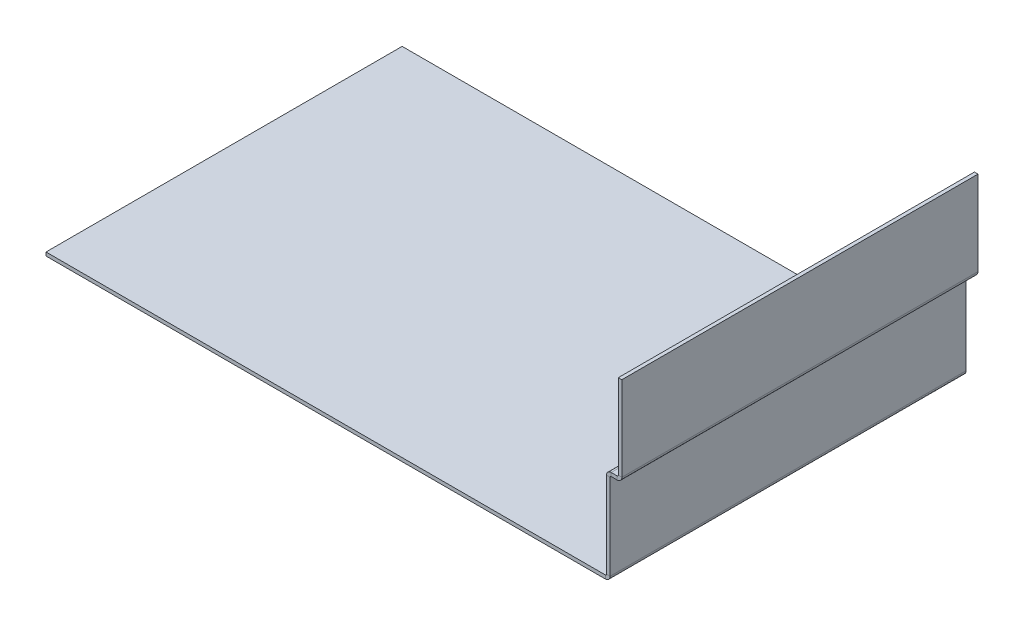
ISO-10303-21;
HEADER;
FILE_DESCRIPTION(('STEP AP214'),'2;1');
FILE_NAME('part.step','',(''),(''),'','','');
FILE_SCHEMA(('AUTOMOTIVE_DESIGN { 1 0 10303 214 1 1 1 1 }'));
ENDSEC;
DATA;
#1=APPLICATION_CONTEXT('core data for automotive mechanical design processes');
#2=APPLICATION_PROTOCOL_DEFINITION('international standard','automotive_design',2000,#1);
#3=PRODUCT_CONTEXT('',#1,'mechanical');
#4=PRODUCT('Part','Part','',(#3));
#5=PRODUCT_RELATED_PRODUCT_CATEGORY('part','',(#4));
#6=PRODUCT_DEFINITION_FORMATION('','',#4);
#7=PRODUCT_DEFINITION_CONTEXT('part definition',#1,'design');
#8=PRODUCT_DEFINITION('design','',#6,#7);
#9=PRODUCT_DEFINITION_SHAPE('','',#8);
#10=(LENGTH_UNIT() NAMED_UNIT(*) SI_UNIT(.MILLI.,.METRE.));
#11=(NAMED_UNIT(*) PLANE_ANGLE_UNIT() SI_UNIT($,.RADIAN.));
#12=(NAMED_UNIT(*) SI_UNIT($,.STERADIAN.) SOLID_ANGLE_UNIT());
#13=UNCERTAINTY_MEASURE_WITH_UNIT(LENGTH_MEASURE(1.E-05),#10,'distance_accuracy_value','');
#14=(GEOMETRIC_REPRESENTATION_CONTEXT(3) GLOBAL_UNCERTAINTY_ASSIGNED_CONTEXT((#13)) GLOBAL_UNIT_ASSIGNED_CONTEXT((#10,
#11,#12)) REPRESENTATION_CONTEXT('',''));
#15=CARTESIAN_POINT('',(0.,0.,0.));
#16=DIRECTION('',(0.,0.,1.));
#17=DIRECTION('',(1.,0.,0.));
#18=AXIS2_PLACEMENT_3D('',#15,#16,#17);
#19=CARTESIAN_POINT('',(139.863855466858,19.6942721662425,0.));
#20=DIRECTION('',(0.,1.,0.));
#21=DIRECTION('',(-1.,0.,0.));
#22=AXIS2_PLACEMENT_3D('',#19,#20,#21);
#23=PLANE('',#22);
#24=DIRECTION('',(1.,0.,0.));
#25=VECTOR('',#24,1.);
#26=CARTESIAN_POINT('',(139.863855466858,19.6942721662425,-76.5167255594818));
#27=LINE('',#26,#25);
#28=CARTESIAN_POINT('',(121.439583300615,19.6942721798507,-76.5167255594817));
#29=VERTEX_POINT('',#28);
#30=CARTESIAN_POINT('',(122.709583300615,19.6942721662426,-76.5167255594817));
#31=VERTEX_POINT('',#30);
#32=EDGE_CURVE('E282',#29,#31,#27,.T.);
#33=ORIENTED_EDGE('',*,*,#32,.T.);
#34=DIRECTION('',(0.,0.,1.));
#35=VECTOR('',#34,1.);
#36=CARTESIAN_POINT('',(122.709583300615,19.6942721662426,0.));
#37=LINE('',#36,#35);
#38=CARTESIAN_POINT('',(122.709583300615,19.6942720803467,0.));
#39=VERTEX_POINT('',#38);
#40=EDGE_CURVE('E42',#31,#39,#37,.T.);
#41=ORIENTED_EDGE('',*,*,#40,.T.);
#42=DIRECTION('',(-1.,0.,0.));
#43=VECTOR('',#42,1.);
#44=CARTESIAN_POINT('',(101.763855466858,19.6942721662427,0.));
#45=LINE('',#44,#43);
#46=CARTESIAN_POINT('',(121.439583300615,19.6942721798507,0.));
#47=VERTEX_POINT('',#46);
#48=EDGE_CURVE('E298',#39,#47,#45,.T.);
#49=ORIENTED_EDGE('',*,*,#48,.T.);
#50=DIRECTION('',(0.,0.,1.));
#51=VECTOR('',#50,1.);
#52=CARTESIAN_POINT('',(121.439583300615,19.6942721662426,0.));
#53=LINE('',#52,#51);
#54=EDGE_CURVE('E284',#29,#47,#53,.T.);
#55=ORIENTED_EDGE('',*,*,#54,.F.);
#56=EDGE_LOOP('',(#33,#41,#49,#55));
#57=FACE_BOUND('',#56,.T.);
#58=ADVANCED_FACE('F33',(#57),#23,.F.);
#59=CARTESIAN_POINT('',(139.863855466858,19.6942721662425,-76.5167255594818));
#60=DIRECTION('',(0.,0.,1.));
#61=DIRECTION('',(0.,-1.,0.));
#62=AXIS2_PLACEMENT_3D('',#59,#60,#61);
#63=PLANE('',#62);
#64=DIRECTION('',(1.,0.,0.));
#65=VECTOR('',#64,1.);
#66=CARTESIAN_POINT('',(139.863855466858,20.4562721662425,-76.5167255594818));
#67=LINE('',#66,#65);
#68=CARTESIAN_POINT('',(121.439583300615,20.4562721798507,-76.5167255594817));
#69=VERTEX_POINT('',#68);
#70=CARTESIAN_POINT('',(122.709583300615,20.4562721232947,-76.5167255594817));
#71=VERTEX_POINT('',#70);
#72=EDGE_CURVE('E295',#69,#71,#67,.T.);
#73=ORIENTED_EDGE('',*,*,#72,.T.);
#74=DIRECTION('',(0.,-1.,0.));
#75=VECTOR('',#74,1.);
#76=CARTESIAN_POINT('',(122.709583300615,19.6942721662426,-76.5167255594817));
#77=LINE('',#76,#75);
#78=EDGE_CURVE('E12',#71,#31,#77,.T.);
#79=ORIENTED_EDGE('',*,*,#78,.T.);
#80=ORIENTED_EDGE('',*,*,#32,.F.);
#81=DIRECTION('',(0.,-1.,0.));
#82=VECTOR('',#81,1.);
#83=CARTESIAN_POINT('',(121.439583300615,19.6942721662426,-76.5167255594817));
#84=LINE('',#83,#82);
#85=EDGE_CURVE('E281',#69,#29,#84,.T.);
#86=ORIENTED_EDGE('',*,*,#85,.F.);
#87=EDGE_LOOP('',(#73,#79,#80,#86));
#88=FACE_BOUND('',#87,.T.);
#89=ADVANCED_FACE('F35',(#88),#63,.F.);
#90=CARTESIAN_POINT('',(101.763855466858,19.6942721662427,0.));
#91=DIRECTION('',(0.,0.,-1.));
#92=DIRECTION('',(0.,1.,0.));
#93=AXIS2_PLACEMENT_3D('',#90,#91,#92);
#94=PLANE('',#93);
#95=ORIENTED_EDGE('',*,*,#48,.F.);
#96=DIRECTION('',(0.,1.,0.));
#97=VECTOR('',#96,1.);
#98=CARTESIAN_POINT('',(122.709583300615,19.6942721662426,0.));
#99=LINE('',#98,#97);
#100=CARTESIAN_POINT('',(122.709583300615,20.4562720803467,0.));
#101=VERTEX_POINT('',#100);
#102=EDGE_CURVE('E290',#39,#101,#99,.T.);
#103=ORIENTED_EDGE('',*,*,#102,.T.);
#104=DIRECTION('',(-1.,0.,0.));
#105=VECTOR('',#104,1.);
#106=CARTESIAN_POINT('',(101.763855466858,20.4562721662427,0.));
#107=LINE('',#106,#105);
#108=CARTESIAN_POINT('',(121.439583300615,20.4562721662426,0.));
#109=VERTEX_POINT('',#108);
#110=EDGE_CURVE('E37',#101,#109,#107,.T.);
#111=ORIENTED_EDGE('',*,*,#110,.T.);
#112=DIRECTION('',(0.,1.,0.));
#113=VECTOR('',#112,1.);
#114=CARTESIAN_POINT('',(121.439583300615,19.6942721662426,0.));
#115=LINE('',#114,#113);
#116=EDGE_CURVE('E286',#47,#109,#115,.T.);
#117=ORIENTED_EDGE('',*,*,#116,.F.);
#118=EDGE_LOOP('',(#95,#103,#111,#117));
#119=FACE_BOUND('',#118,.T.);
#120=ADVANCED_FACE('F320',(#119),#94,.F.);
#121=CARTESIAN_POINT('',(139.863855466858,20.4562721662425,0.));
#122=DIRECTION('',(0.,1.,0.));
#123=DIRECTION('',(-1.,0.,0.));
#124=AXIS2_PLACEMENT_3D('',#121,#122,#123);
#125=PLANE('',#124);
#126=DIRECTION('',(0.,0.,1.));
#127=VECTOR('',#126,1.);
#128=CARTESIAN_POINT('',(122.709583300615,20.4562721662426,0.));
#129=LINE('',#128,#127);
#130=EDGE_CURVE('E288',#71,#101,#129,.T.);
#131=ORIENTED_EDGE('',*,*,#130,.F.);
#132=ORIENTED_EDGE('',*,*,#72,.F.);
#133=DIRECTION('',(0.,0.,1.));
#134=VECTOR('',#133,1.);
#135=CARTESIAN_POINT('',(121.439583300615,20.4562721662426,0.));
#136=LINE('',#135,#134);
#137=EDGE_CURVE('E278',#69,#109,#136,.T.);
#138=ORIENTED_EDGE('',*,*,#137,.T.);
#139=ORIENTED_EDGE('',*,*,#110,.F.);
#140=EDGE_LOOP('',(#131,#132,#138,#139));
#141=FACE_BOUND('',#140,.T.);
#142=ADVANCED_FACE('F315',(#141),#125,.T.);
#143=CARTESIAN_POINT('',(0.,0.762,-76.5167255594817));
#144=DIRECTION('',(1.,0.,0.));
#145=DIRECTION('',(0.,0.,-1.));
#146=AXIS2_PLACEMENT_3D('',#143,#144,#145);
#147=PLANE('',#146);
#148=DIRECTION('',(0.,0.,1.));
#149=VECTOR('',#148,1.);
#150=CARTESIAN_POINT('',(0.,0.,-76.5167255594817));
#151=LINE('',#150,#149);
#152=CARTESIAN_POINT('',(0.,0.,-76.5167255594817));
#153=VERTEX_POINT('',#152);
#154=CARTESIAN_POINT('',(0.,0.,0.));
#155=VERTEX_POINT('',#154);
#156=EDGE_CURVE('E274',#153,#155,#151,.T.);
#157=ORIENTED_EDGE('',*,*,#156,.T.);
#158=DIRECTION('',(0.,-1.,0.));
#159=VECTOR('',#158,1.);
#160=CARTESIAN_POINT('',(0.,0.762,0.));
#161=LINE('',#160,#159);
#162=CARTESIAN_POINT('',(0.,0.762,0.));
#163=VERTEX_POINT('',#162);
#164=EDGE_CURVE('E268',#163,#155,#161,.T.);
#165=ORIENTED_EDGE('',*,*,#164,.F.);
#166=DIRECTION('',(0.,0.,1.));
#167=VECTOR('',#166,1.);
#168=CARTESIAN_POINT('',(0.,0.762,-76.5167255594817));
#169=LINE('',#168,#167);
#170=CARTESIAN_POINT('',(0.,0.762,-76.5167255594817));
#171=VERTEX_POINT('',#170);
#172=EDGE_CURVE('E251',#171,#163,#169,.T.);
#173=ORIENTED_EDGE('',*,*,#172,.F.);
#174=DIRECTION('',(0.,-1.,0.));
#175=VECTOR('',#174,1.);
#176=CARTESIAN_POINT('',(0.,0.762,-76.5167255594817));
#177=LINE('',#176,#175);
#178=EDGE_CURVE('E271',#171,#153,#177,.T.);
#179=ORIENTED_EDGE('',*,*,#178,.T.);
#180=EDGE_LOOP('',(#157,#165,#173,#179));
#181=FACE_BOUND('',#180,.T.);
#182=ADVANCED_FACE('F356',(#181),#147,.F.);
#183=CARTESIAN_POINT('',(0.,0.762,0.));
#184=DIRECTION('',(0.,0.,-1.));
#185=DIRECTION('',(-1.,0.,0.));
#186=AXIS2_PLACEMENT_3D('',#183,#184,#185);
#187=PLANE('',#186);
#188=DIRECTION('',(0.,-1.,0.));
#189=VECTOR('',#188,1.);
#190=CARTESIAN_POINT('',(120.169583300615,0.762,0.));
#191=LINE('',#190,#189);
#192=CARTESIAN_POINT('',(120.169583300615,0.762,0.));
#193=VERTEX_POINT('',#192);
#194=CARTESIAN_POINT('',(120.169583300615,0.,0.));
#195=VERTEX_POINT('',#194);
#196=EDGE_CURVE('E248',#193,#195,#191,.T.);
#197=ORIENTED_EDGE('',*,*,#196,.F.);
#198=DIRECTION('',(1.,0.,0.));
#199=VECTOR('',#198,1.);
#200=CARTESIAN_POINT('',(0.,0.762,0.));
#201=LINE('',#200,#199);
#202=EDGE_CURVE('E256',#163,#193,#201,.T.);
#203=ORIENTED_EDGE('',*,*,#202,.F.);
#204=ORIENTED_EDGE('',*,*,#164,.T.);
#205=DIRECTION('',(1.,0.,0.));
#206=VECTOR('',#205,1.);
#207=CARTESIAN_POINT('',(0.,0.,0.));
#208=LINE('',#207,#206);
#209=EDGE_CURVE('E265',#155,#195,#208,.T.);
#210=ORIENTED_EDGE('',*,*,#209,.T.);
#211=EDGE_LOOP('',(#197,#203,#204,#210));
#212=FACE_BOUND('',#211,.T.);
#213=ADVANCED_FACE('F401',(#212),#187,.F.);
#214=CARTESIAN_POINT('',(0.,0.,0.));
#215=DIRECTION('',(0.,1.,0.));
#216=DIRECTION('',(0.,0.,1.));
#217=AXIS2_PLACEMENT_3D('',#214,#215,#216);
#218=PLANE('',#217);
#219=DIRECTION('',(0.,0.,-1.));
#220=VECTOR('',#219,1.);
#221=CARTESIAN_POINT('',(120.169583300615,0.,-76.5167255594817));
#222=LINE('',#221,#220);
#223=CARTESIAN_POINT('',(120.169583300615,0.,-76.5167255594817));
#224=VERTEX_POINT('',#223);
#225=EDGE_CURVE('E263',#224,#195,#222,.F.);
#226=ORIENTED_EDGE('',*,*,#225,.T.);
#227=ORIENTED_EDGE('',*,*,#209,.F.);
#228=ORIENTED_EDGE('',*,*,#156,.F.);
#229=DIRECTION('',(-1.,0.,0.));
#230=VECTOR('',#229,1.);
#231=CARTESIAN_POINT('',(0.,0.,-76.5167255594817));
#232=LINE('',#231,#230);
#233=EDGE_CURVE('E259',#224,#153,#232,.T.);
#234=ORIENTED_EDGE('',*,*,#233,.F.);
#235=EDGE_LOOP('',(#226,#227,#228,#234));
#236=FACE_BOUND('',#235,.T.);
#237=ADVANCED_FACE('F397',(#236),#218,.F.);
#238=CARTESIAN_POINT('',(0.,0.762,-76.5167255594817));
#239=DIRECTION('',(0.,0.,1.));
#240=DIRECTION('',(1.,0.,0.));
#241=AXIS2_PLACEMENT_3D('',#238,#239,#240);
#242=PLANE('',#241);
#243=DIRECTION('',(0.,-1.,0.));
#244=VECTOR('',#243,1.);
#245=CARTESIAN_POINT('',(120.169583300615,0.762,-76.5167255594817));
#246=LINE('',#245,#244);
#247=CARTESIAN_POINT('',(120.169583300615,0.762,-76.5167255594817));
#248=VERTEX_POINT('',#247);
#249=EDGE_CURVE('E261',#248,#224,#246,.T.);
#250=ORIENTED_EDGE('',*,*,#249,.T.);
#251=ORIENTED_EDGE('',*,*,#233,.T.);
#252=ORIENTED_EDGE('',*,*,#178,.F.);
#253=DIRECTION('',(-1.,0.,0.));
#254=VECTOR('',#253,1.);
#255=CARTESIAN_POINT('',(0.,0.762,-76.5167255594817));
#256=LINE('',#255,#254);
#257=EDGE_CURVE('E254',#248,#171,#256,.T.);
#258=ORIENTED_EDGE('',*,*,#257,.F.);
#259=EDGE_LOOP('',(#250,#251,#252,#258));
#260=FACE_BOUND('',#259,.T.);
#261=ADVANCED_FACE('F393',(#260),#242,.F.);
#262=CARTESIAN_POINT('',(0.,0.762,0.));
#263=DIRECTION('',(0.,1.,0.));
#264=DIRECTION('',(0.,0.,1.));
#265=AXIS2_PLACEMENT_3D('',#262,#263,#264);
#266=PLANE('',#265);
#267=ORIENTED_EDGE('',*,*,#202,.T.);
#268=DIRECTION('',(0.,0.,-1.));
#269=VECTOR('',#268,1.);
#270=CARTESIAN_POINT('',(120.169583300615,0.762,-76.5167255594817));
#271=LINE('',#270,#269);
#272=EDGE_CURVE('E233',#248,#193,#271,.F.);
#273=ORIENTED_EDGE('',*,*,#272,.F.);
#274=ORIENTED_EDGE('',*,*,#257,.T.);
#275=ORIENTED_EDGE('',*,*,#172,.T.);
#276=EDGE_LOOP('',(#267,#273,#274,#275));
#277=FACE_BOUND('',#276,.T.);
#278=ADVANCED_FACE('F389',(#277),#266,.T.);
#279=CARTESIAN_POINT('',(120.169583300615,1.016,0.));
#280=DIRECTION('',(0.,0.,1.));
#281=DIRECTION('',(1.,0.,0.));
#282=AXIS2_PLACEMENT_3D('',#279,#280,#281);
#283=PLANE('',#282);
#284=DIRECTION('',(1.,0.,0.));
#285=VECTOR('',#284,1.);
#286=CARTESIAN_POINT('',(120.423583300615,1.016,0.));
#287=LINE('',#286,#285);
#288=CARTESIAN_POINT('',(120.423583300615,1.016,0.));
#289=VERTEX_POINT('',#288);
#290=CARTESIAN_POINT('',(121.185583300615,1.016,0.));
#291=VERTEX_POINT('',#290);
#292=EDGE_CURVE('E203',#289,#291,#287,.T.);
#293=ORIENTED_EDGE('',*,*,#292,.F.);
#294=CARTESIAN_POINT('',(120.169583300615,1.016,0.));
#295=DIRECTION('',(0.,0.,-1.));
#296=DIRECTION('',(-1.,0.,0.));
#297=AXIS2_PLACEMENT_3D('',#294,#295,#296);
#298=CIRCLE('',#297,0.254000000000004);
#299=EDGE_CURVE('E230',#193,#289,#298,.F.);
#300=ORIENTED_EDGE('',*,*,#299,.F.);
#301=ORIENTED_EDGE('',*,*,#196,.T.);
#302=CARTESIAN_POINT('',(120.169583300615,1.016,0.));
#303=DIRECTION('',(0.,0.,-1.));
#304=DIRECTION('',(-1.,0.,0.));
#305=AXIS2_PLACEMENT_3D('',#302,#303,#304);
#306=CIRCLE('',#305,1.016);
#307=EDGE_CURVE('E245',#195,#291,#306,.F.);
#308=ORIENTED_EDGE('',*,*,#307,.T.);
#309=EDGE_LOOP('',(#293,#300,#301,#308));
#310=FACE_BOUND('',#309,.T.);
#311=ADVANCED_FACE('F385',(#310),#283,.T.);
#312=CARTESIAN_POINT('',(120.169583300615,1.016,-76.5167255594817));
#313=DIRECTION('',(0.,0.,-1.));
#314=DIRECTION('',(1.,0.,0.));
#315=AXIS2_PLACEMENT_3D('',#312,#313,#314);
#316=CYLINDRICAL_SURFACE('',#315,1.016);
#317=ORIENTED_EDGE('',*,*,#225,.F.);
#318=CARTESIAN_POINT('',(120.169583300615,1.016,-76.5167255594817));
#319=DIRECTION('',(0.,0.,-1.));
#320=DIRECTION('',(-1.,0.,0.));
#321=AXIS2_PLACEMENT_3D('',#318,#319,#320);
#322=CIRCLE('',#321,1.016);
#323=CARTESIAN_POINT('',(121.185583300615,1.016,-76.5167255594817));
#324=VERTEX_POINT('',#323);
#325=EDGE_CURVE('E236',#324,#224,#322,.T.);
#326=ORIENTED_EDGE('',*,*,#325,.F.);
#327=DIRECTION('',(0.,0.,1.));
#328=VECTOR('',#327,1.);
#329=CARTESIAN_POINT('',(121.185583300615,1.016,0.));
#330=LINE('',#329,#328);
#331=EDGE_CURVE('E242',#324,#291,#330,.T.);
#332=ORIENTED_EDGE('',*,*,#331,.T.);
#333=ORIENTED_EDGE('',*,*,#307,.F.);
#334=EDGE_LOOP('',(#317,#326,#332,#333));
#335=FACE_BOUND('',#334,.T.);
#336=ADVANCED_FACE('F381',(#335),#316,.T.);
#337=CARTESIAN_POINT('',(120.169583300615,1.016,-76.5167255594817));
#338=DIRECTION('',(0.,0.,1.));
#339=DIRECTION('',(1.,0.,0.));
#340=AXIS2_PLACEMENT_3D('',#337,#338,#339);
#341=PLANE('',#340);
#342=CARTESIAN_POINT('',(120.169583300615,1.016,-76.5167255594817));
#343=DIRECTION('',(0.,0.,-1.));
#344=DIRECTION('',(-1.,0.,0.));
#345=AXIS2_PLACEMENT_3D('',#342,#343,#344);
#346=CIRCLE('',#345,0.254000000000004);
#347=CARTESIAN_POINT('',(120.423583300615,1.016,-76.5167255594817));
#348=VERTEX_POINT('',#347);
#349=EDGE_CURVE('E225',#348,#248,#346,.T.);
#350=ORIENTED_EDGE('',*,*,#349,.F.);
#351=DIRECTION('',(1.,0.,0.));
#352=VECTOR('',#351,1.);
#353=CARTESIAN_POINT('',(120.423583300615,1.016,-76.5167255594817));
#354=LINE('',#353,#352);
#355=EDGE_CURVE('E239',#348,#324,#354,.T.);
#356=ORIENTED_EDGE('',*,*,#355,.T.);
#357=ORIENTED_EDGE('',*,*,#325,.T.);
#358=ORIENTED_EDGE('',*,*,#249,.F.);
#359=EDGE_LOOP('',(#350,#356,#357,#358));
#360=FACE_BOUND('',#359,.T.);
#361=ADVANCED_FACE('F377',(#360),#341,.F.);
#362=CARTESIAN_POINT('',(120.169583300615,1.016,-76.5167255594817));
#363=DIRECTION('',(0.,0.,-1.));
#364=DIRECTION('',(1.,0.,0.));
#365=AXIS2_PLACEMENT_3D('',#362,#363,#364);
#366=CYLINDRICAL_SURFACE('',#365,0.254000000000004);
#367=ORIENTED_EDGE('',*,*,#272,.T.);
#368=ORIENTED_EDGE('',*,*,#299,.T.);
#369=DIRECTION('',(0.,0.,-1.));
#370=VECTOR('',#369,1.);
#371=CARTESIAN_POINT('',(120.423583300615,1.016,0.));
#372=LINE('',#371,#370);
#373=EDGE_CURVE('E228',#289,#348,#372,.T.);
#374=ORIENTED_EDGE('',*,*,#373,.T.);
#375=ORIENTED_EDGE('',*,*,#349,.T.);
#376=EDGE_LOOP('',(#367,#368,#374,#375));
#377=FACE_BOUND('',#376,.T.);
#378=ADVANCED_FACE('F373',(#377),#366,.F.);
#379=CARTESIAN_POINT('',(120.423583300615,38.862,0.));
#380=DIRECTION('',(-1.,0.,0.));
#381=DIRECTION('',(0.,-1.,0.));
#382=AXIS2_PLACEMENT_3D('',#379,#380,#381);
#383=PLANE('',#382);
#384=DIRECTION('',(0.,0.,1.));
#385=VECTOR('',#384,1.);
#386=CARTESIAN_POINT('',(120.423583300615,19.4402721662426,0.));
#387=LINE('',#386,#385);
#388=CARTESIAN_POINT('',(120.423583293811,19.4402721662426,-76.5167255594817));
#389=VERTEX_POINT('',#388);
#390=CARTESIAN_POINT('',(120.423583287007,19.4402721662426,0.));
#391=VERTEX_POINT('',#390);
#392=EDGE_CURVE('E202',#389,#391,#387,.T.);
#393=ORIENTED_EDGE('',*,*,#392,.F.);
#394=DIRECTION('',(0.,1.,0.));
#395=VECTOR('',#394,1.);
#396=CARTESIAN_POINT('',(120.423583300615,38.862,-76.5167255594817));
#397=LINE('',#396,#395);
#398=EDGE_CURVE('E222',#348,#389,#397,.T.);
#399=ORIENTED_EDGE('',*,*,#398,.F.);
#400=ORIENTED_EDGE('',*,*,#373,.F.);
#401=DIRECTION('',(0.,-1.,0.));
#402=VECTOR('',#401,1.);
#403=CARTESIAN_POINT('',(120.423583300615,0.762,0.));
#404=LINE('',#403,#402);
#405=EDGE_CURVE('E206',#391,#289,#404,.T.);
#406=ORIENTED_EDGE('',*,*,#405,.F.);
#407=EDGE_LOOP('',(#393,#399,#400,#406));
#408=FACE_BOUND('',#407,.T.);
#409=ADVANCED_FACE('F369',(#408),#383,.T.);
#410=CARTESIAN_POINT('',(121.185583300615,38.862,-76.5167255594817));
#411=DIRECTION('',(0.,0.,1.));
#412=DIRECTION('',(1.,0.,0.));
#413=AXIS2_PLACEMENT_3D('',#410,#411,#412);
#414=PLANE('',#413);
#415=ORIENTED_EDGE('',*,*,#398,.T.);
#416=DIRECTION('',(1.,0.,0.));
#417=VECTOR('',#416,1.);
#418=CARTESIAN_POINT('',(121.185583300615,19.4402721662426,-76.5167255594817));
#419=LINE('',#418,#417);
#420=CARTESIAN_POINT('',(121.185583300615,19.4402721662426,-76.5167255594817));
#421=VERTEX_POINT('',#420);
#422=EDGE_CURVE('E219',#389,#421,#419,.T.);
#423=ORIENTED_EDGE('',*,*,#422,.T.);
#424=DIRECTION('',(0.,1.,0.));
#425=VECTOR('',#424,1.);
#426=CARTESIAN_POINT('',(121.185583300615,38.862,-76.5167255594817));
#427=LINE('',#426,#425);
#428=EDGE_CURVE('E216',#324,#421,#427,.T.);
#429=ORIENTED_EDGE('',*,*,#428,.F.);
#430=ORIENTED_EDGE('',*,*,#355,.F.);
#431=EDGE_LOOP('',(#415,#423,#429,#430));
#432=FACE_BOUND('',#431,.T.);
#433=ADVANCED_FACE('F365',(#432),#414,.F.);
#434=CARTESIAN_POINT('',(121.185583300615,38.862,0.));
#435=DIRECTION('',(-1.,0.,0.));
#436=DIRECTION('',(0.,-1.,0.));
#437=AXIS2_PLACEMENT_3D('',#434,#435,#436);
#438=PLANE('',#437);
#439=ORIENTED_EDGE('',*,*,#428,.T.);
#440=DIRECTION('',(0.,0.,1.));
#441=VECTOR('',#440,1.);
#442=CARTESIAN_POINT('',(121.185583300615,19.4402721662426,0.));
#443=LINE('',#442,#441);
#444=CARTESIAN_POINT('',(121.185583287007,19.4402721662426,0.));
#445=VERTEX_POINT('',#444);
#446=EDGE_CURVE('E213',#421,#445,#443,.T.);
#447=ORIENTED_EDGE('',*,*,#446,.T.);
#448=DIRECTION('',(0.,-1.,0.));
#449=VECTOR('',#448,1.);
#450=CARTESIAN_POINT('',(121.185583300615,0.761999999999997,0.));
#451=LINE('',#450,#449);
#452=EDGE_CURVE('E211',#445,#291,#451,.T.);
#453=ORIENTED_EDGE('',*,*,#452,.T.);
#454=ORIENTED_EDGE('',*,*,#331,.F.);
#455=EDGE_LOOP('',(#439,#447,#453,#454));
#456=FACE_BOUND('',#455,.T.);
#457=ADVANCED_FACE('F361',(#456),#438,.F.);
#458=CARTESIAN_POINT('',(121.185583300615,0.761999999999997,0.));
#459=DIRECTION('',(0.,0.,-1.));
#460=DIRECTION('',(-1.,0.,0.));
#461=AXIS2_PLACEMENT_3D('',#458,#459,#460);
#462=PLANE('',#461);
#463=ORIENTED_EDGE('',*,*,#452,.F.);
#464=DIRECTION('',(-1.,0.,0.));
#465=VECTOR('',#464,1.);
#466=CARTESIAN_POINT('',(121.185583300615,19.4402721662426,0.));
#467=LINE('',#466,#465);
#468=EDGE_CURVE('E208',#445,#391,#467,.T.);
#469=ORIENTED_EDGE('',*,*,#468,.T.);
#470=ORIENTED_EDGE('',*,*,#405,.T.);
#471=ORIENTED_EDGE('',*,*,#292,.T.);
#472=EDGE_LOOP('',(#463,#469,#470,#471));
#473=FACE_BOUND('',#472,.T.);
#474=ADVANCED_FACE('F357',(#473),#462,.F.);
#475=CARTESIAN_POINT('',(121.439583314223,19.4402721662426,-76.5167255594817));
#476=DIRECTION('',(0.,0.,-1.));
#477=DIRECTION('',(-1.,0.,0.));
#478=AXIS2_PLACEMENT_3D('',#475,#476,#477);
#479=PLANE('',#478);
#480=ORIENTED_EDGE('',*,*,#85,.T.);
#481=CARTESIAN_POINT('',(121.439583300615,19.4402721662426,-76.5167255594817));
#482=DIRECTION('',(0.,0.,-1.));
#483=DIRECTION('',(0.,1.,0.));
#484=AXIS2_PLACEMENT_3D('',#481,#482,#483);
#485=CIRCLE('',#484,0.254000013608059);
#486=EDGE_CURVE('E193',#29,#421,#485,.F.);
#487=ORIENTED_EDGE('',*,*,#486,.T.);
#488=ORIENTED_EDGE('',*,*,#422,.F.);
#489=CARTESIAN_POINT('',(121.439583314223,19.4402721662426,-76.5167255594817));
#490=DIRECTION('',(0.,0.,1.));
#491=DIRECTION('',(-1.,0.,0.));
#492=AXIS2_PLACEMENT_3D('',#489,#490,#491);
#493=CIRCLE('',#492,1.01600002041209);
#494=EDGE_CURVE('E198',#69,#389,#493,.T.);
#495=ORIENTED_EDGE('',*,*,#494,.F.);
#496=EDGE_LOOP('',(#480,#487,#488,#495));
#497=FACE_BOUND('',#496,.T.);
#498=ADVANCED_FACE('F360',(#497),#479,.T.);
#499=CARTESIAN_POINT('',(121.439583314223,19.4402721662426,0.));
#500=DIRECTION('',(0.,0.,1.));
#501=DIRECTION('',(0.,-1.,0.));
#502=AXIS2_PLACEMENT_3D('',#499,#500,#501);
#503=PLANE('',#502);
#504=CARTESIAN_POINT('',(121.439583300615,19.4402721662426,0.));
#505=DIRECTION('',(0.,0.,-1.));
#506=DIRECTION('',(0.,1.,0.));
#507=AXIS2_PLACEMENT_3D('',#504,#505,#506);
#508=CIRCLE('',#507,0.254000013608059);
#509=EDGE_CURVE('E195',#445,#47,#508,.T.);
#510=ORIENTED_EDGE('',*,*,#509,.T.);
#511=ORIENTED_EDGE('',*,*,#116,.T.);
#512=CARTESIAN_POINT('',(121.439583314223,19.4402721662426,0.));
#513=DIRECTION('',(0.,0.,-1.));
#514=DIRECTION('',(0.,-1.,0.));
#515=AXIS2_PLACEMENT_3D('',#512,#513,#514);
#516=CIRCLE('',#515,1.01600002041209);
#517=EDGE_CURVE('E58',#391,#109,#516,.T.);
#518=ORIENTED_EDGE('',*,*,#517,.F.);
#519=ORIENTED_EDGE('',*,*,#468,.F.);
#520=EDGE_LOOP('',(#510,#511,#518,#519));
#521=FACE_BOUND('',#520,.T.);
#522=ADVANCED_FACE('F409',(#521),#503,.T.);
#523=CARTESIAN_POINT('',(121.439583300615,19.4402721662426,38.2686576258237));
#524=DIRECTION('',(0.,0.,-1.));
#525=DIRECTION('',(0.,1.,0.));
#526=AXIS2_PLACEMENT_3D('',#523,#524,#525);
#527=CYLINDRICAL_SURFACE('',#526,1.01600001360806);
#528=ORIENTED_EDGE('',*,*,#392,.T.);
#529=ORIENTED_EDGE('',*,*,#517,.T.);
#530=ORIENTED_EDGE('',*,*,#137,.F.);
#531=ORIENTED_EDGE('',*,*,#494,.T.);
#532=EDGE_LOOP('',(#528,#529,#530,#531));
#533=FACE_BOUND('',#532,.T.);
#534=ADVANCED_FACE('F412',(#533),#527,.T.);
#535=CARTESIAN_POINT('',(121.439583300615,19.4402721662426,38.2686576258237));
#536=DIRECTION('',(0.,0.,-1.));
#537=DIRECTION('',(0.,1.,0.));
#538=AXIS2_PLACEMENT_3D('',#535,#536,#537);
#539=CYLINDRICAL_SURFACE('',#538,0.254000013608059);
#540=ORIENTED_EDGE('',*,*,#446,.F.);
#541=ORIENTED_EDGE('',*,*,#486,.F.);
#542=ORIENTED_EDGE('',*,*,#54,.T.);
#543=ORIENTED_EDGE('',*,*,#509,.F.);
#544=EDGE_LOOP('',(#540,#541,#542,#543));
#545=FACE_BOUND('',#544,.T.);
#546=ADVANCED_FACE('F414',(#545),#539,.F.);
#547=CARTESIAN_POINT('',(122.709583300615,20.7102722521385,-76.5167255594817));
#548=DIRECTION('',(0.,0.,1.));
#549=DIRECTION('',(1.,0.,0.));
#550=AXIS2_PLACEMENT_3D('',#547,#548,#549);
#551=PLANE('',#550);
#552=DIRECTION('',(1.,0.,0.));
#553=VECTOR('',#552,1.);
#554=CARTESIAN_POINT('',(123.725583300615,20.7102721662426,-76.5167255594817));
#555=LINE('',#554,#553);
#556=CARTESIAN_POINT('',(122.963583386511,20.7102721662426,-76.5167255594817));
#557=VERTEX_POINT('',#556);
#558=CARTESIAN_POINT('',(123.725583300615,20.7102721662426,-76.5167255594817));
#559=VERTEX_POINT('',#558);
#560=EDGE_CURVE('E154',#557,#559,#555,.T.);
#561=ORIENTED_EDGE('',*,*,#560,.T.);
#562=CARTESIAN_POINT('',(122.709583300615,20.7102721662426,-76.5167255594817));
#563=DIRECTION('',(0.,0.,-1.));
#564=DIRECTION('',(0.,1.,0.));
#565=AXIS2_PLACEMENT_3D('',#562,#563,#564);
#566=CIRCLE('',#565,1.01600008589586);
#567=EDGE_CURVE('E50',#559,#31,#566,.T.);
#568=ORIENTED_EDGE('',*,*,#567,.T.);
#569=ORIENTED_EDGE('',*,*,#78,.F.);
#570=CARTESIAN_POINT('',(122.709583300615,20.7102722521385,-76.5167255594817));
#571=DIRECTION('',(0.,0.,-1.));
#572=DIRECTION('',(1.,0.,0.));
#573=AXIS2_PLACEMENT_3D('',#570,#571,#572);
#574=CIRCLE('',#573,0.254000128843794);
#575=EDGE_CURVE('E187',#557,#71,#574,.T.);
#576=ORIENTED_EDGE('',*,*,#575,.F.);
#577=EDGE_LOOP('',(#561,#568,#569,#576));
#578=FACE_BOUND('',#577,.T.);
#579=ADVANCED_FACE('F308',(#578),#551,.F.);
#580=CARTESIAN_POINT('',(122.709583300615,20.7102722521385,0.));
#581=DIRECTION('',(0.,0.,-1.));
#582=DIRECTION('',(0.,1.,0.));
#583=AXIS2_PLACEMENT_3D('',#580,#581,#582);
#584=PLANE('',#583);
#585=CARTESIAN_POINT('',(122.709583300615,20.7102721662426,0.));
#586=DIRECTION('',(0.,0.,-1.));
#587=DIRECTION('',(0.,1.,0.));
#588=AXIS2_PLACEMENT_3D('',#585,#586,#587);
#589=CIRCLE('',#588,1.01600008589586);
#590=CARTESIAN_POINT('',(123.725583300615,20.7102721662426,0.));
#591=VERTEX_POINT('',#590);
#592=EDGE_CURVE('E184',#39,#591,#589,.F.);
#593=ORIENTED_EDGE('',*,*,#592,.T.);
#594=DIRECTION('',(-1.,0.,0.));
#595=VECTOR('',#594,1.);
#596=CARTESIAN_POINT('',(123.725583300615,20.7102721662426,0.));
#597=LINE('',#596,#595);
#598=CARTESIAN_POINT('',(122.963583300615,20.7102721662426,0.));
#599=VERTEX_POINT('',#598);
#600=EDGE_CURVE('E173',#591,#599,#597,.T.);
#601=ORIENTED_EDGE('',*,*,#600,.T.);
#602=CARTESIAN_POINT('',(122.709583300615,20.7102722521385,0.));
#603=DIRECTION('',(0.,0.,1.));
#604=DIRECTION('',(0.,1.,0.));
#605=AXIS2_PLACEMENT_3D('',#602,#603,#604);
#606=CIRCLE('',#605,0.254000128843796);
#607=EDGE_CURVE('E190',#101,#599,#606,.T.);
#608=ORIENTED_EDGE('',*,*,#607,.F.);
#609=ORIENTED_EDGE('',*,*,#102,.F.);
#610=EDGE_LOOP('',(#593,#601,#608,#609));
#611=FACE_BOUND('',#610,.T.);
#612=ADVANCED_FACE('F323',(#611),#584,.F.);
#613=CARTESIAN_POINT('',(122.709583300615,20.7102721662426,38.2686576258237));
#614=DIRECTION('',(0.,0.,-1.));
#615=DIRECTION('',(0.,1.,0.));
#616=AXIS2_PLACEMENT_3D('',#613,#614,#615);
#617=CYLINDRICAL_SURFACE('',#616,0.254000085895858);
#618=ORIENTED_EDGE('',*,*,#130,.T.);
#619=ORIENTED_EDGE('',*,*,#607,.T.);
#620=DIRECTION('',(0.,0.,1.));
#621=VECTOR('',#620,1.);
#622=CARTESIAN_POINT('',(122.963583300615,20.7102721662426,0.));
#623=LINE('',#622,#621);
#624=EDGE_CURVE('E168',#557,#599,#623,.T.);
#625=ORIENTED_EDGE('',*,*,#624,.F.);
#626=ORIENTED_EDGE('',*,*,#575,.T.);
#627=EDGE_LOOP('',(#618,#619,#625,#626));
#628=FACE_BOUND('',#627,.T.);
#629=ADVANCED_FACE('F311',(#628),#617,.F.);
#630=CARTESIAN_POINT('',(122.709583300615,20.7102721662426,38.2686576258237));
#631=DIRECTION('',(0.,0.,-1.));
#632=DIRECTION('',(0.,1.,0.));
#633=AXIS2_PLACEMENT_3D('',#630,#631,#632);
#634=CYLINDRICAL_SURFACE('',#633,1.01600008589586);
#635=ORIENTED_EDGE('',*,*,#40,.F.);
#636=ORIENTED_EDGE('',*,*,#567,.F.);
#637=DIRECTION('',(0.,0.,1.));
#638=VECTOR('',#637,1.);
#639=CARTESIAN_POINT('',(123.725583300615,20.7102721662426,0.));
#640=LINE('',#639,#638);
#641=EDGE_CURVE('E176',#559,#591,#640,.T.);
#642=ORIENTED_EDGE('',*,*,#641,.T.);
#643=ORIENTED_EDGE('',*,*,#592,.F.);
#644=EDGE_LOOP('',(#635,#636,#642,#643));
#645=FACE_BOUND('',#644,.T.);
#646=ADVANCED_FACE('F325',(#645),#634,.T.);
#647=CARTESIAN_POINT('',(123.725583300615,38.862,0.));
#648=DIRECTION('',(0.,-1.,0.));
#649=DIRECTION('',(1.,0.,0.));
#650=AXIS2_PLACEMENT_3D('',#647,#648,#649);
#651=PLANE('',#650);
#652=DIRECTION('',(0.,0.,1.));
#653=VECTOR('',#652,1.);
#654=CARTESIAN_POINT('',(122.963583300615,38.862,0.));
#655=LINE('',#654,#653);
#656=CARTESIAN_POINT('',(122.963583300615,38.862,-76.5167255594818));
#657=VERTEX_POINT('',#656);
#658=CARTESIAN_POINT('',(122.963583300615,38.862,0.));
#659=VERTEX_POINT('',#658);
#660=EDGE_CURVE('E164',#657,#659,#655,.T.);
#661=ORIENTED_EDGE('',*,*,#660,.T.);
#662=DIRECTION('',(-1.,0.,0.));
#663=VECTOR('',#662,1.);
#664=CARTESIAN_POINT('',(123.725583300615,38.862,0.));
#665=LINE('',#664,#663);
#666=CARTESIAN_POINT('',(123.725583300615,38.862,0.));
#667=VERTEX_POINT('',#666);
#668=EDGE_CURVE('E334',#667,#659,#665,.T.);
#669=ORIENTED_EDGE('',*,*,#668,.F.);
#670=DIRECTION('',(0.,0.,1.));
#671=VECTOR('',#670,1.);
#672=CARTESIAN_POINT('',(123.725583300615,38.862,0.));
#673=LINE('',#672,#671);
#674=CARTESIAN_POINT('',(123.725583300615,38.862,-76.5167255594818));
#675=VERTEX_POINT('',#674);
#676=EDGE_CURVE('E167',#675,#667,#673,.T.);
#677=ORIENTED_EDGE('',*,*,#676,.F.);
#678=DIRECTION('',(-1.,0.,0.));
#679=VECTOR('',#678,1.);
#680=CARTESIAN_POINT('',(123.725583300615,38.862,-76.5167255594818));
#681=LINE('',#680,#679);
#682=EDGE_CURVE('E152',#675,#657,#681,.T.);
#683=ORIENTED_EDGE('',*,*,#682,.T.);
#684=EDGE_LOOP('',(#661,#669,#677,#683));
#685=FACE_BOUND('',#684,.T.);
#686=ADVANCED_FACE('F162',(#685),#651,.F.);
#687=CARTESIAN_POINT('',(122.963583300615,36.8670886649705,0.));
#688=DIRECTION('',(-1.,0.,0.));
#689=DIRECTION('',(0.,-1.,0.));
#690=AXIS2_PLACEMENT_3D('',#687,#688,#689);
#691=PLANE('',#690);
#692=DIRECTION('',(0.,1.,0.));
#693=VECTOR('',#692,1.);
#694=CARTESIAN_POINT('',(122.963583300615,36.8670886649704,-76.5167255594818));
#695=LINE('',#694,#693);
#696=EDGE_CURVE('E149',#557,#657,#695,.T.);
#697=ORIENTED_EDGE('',*,*,#696,.F.);
#698=ORIENTED_EDGE('',*,*,#624,.T.);
#699=DIRECTION('',(0.,-1.,0.));
#700=VECTOR('',#699,1.);
#701=CARTESIAN_POINT('',(122.963583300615,-1.23291133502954,0.));
#702=LINE('',#701,#700);
#703=EDGE_CURVE('E172',#659,#599,#702,.T.);
#704=ORIENTED_EDGE('',*,*,#703,.F.);
#705=ORIENTED_EDGE('',*,*,#660,.F.);
#706=EDGE_LOOP('',(#697,#698,#704,#705));
#707=FACE_BOUND('',#706,.T.);
#708=ADVANCED_FACE('F170',(#707),#691,.T.);
#709=CARTESIAN_POINT('',(123.725583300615,-1.23291133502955,0.));
#710=DIRECTION('',(0.,0.,-1.));
#711=DIRECTION('',(-1.,0.,0.));
#712=AXIS2_PLACEMENT_3D('',#709,#710,#711);
#713=PLANE('',#712);
#714=ORIENTED_EDGE('',*,*,#600,.F.);
#715=DIRECTION('',(0.,-1.,0.));
#716=VECTOR('',#715,1.);
#717=CARTESIAN_POINT('',(123.725583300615,-1.23291133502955,0.));
#718=LINE('',#717,#716);
#719=EDGE_CURVE('E158',#667,#591,#718,.T.);
#720=ORIENTED_EDGE('',*,*,#719,.F.);
#721=ORIENTED_EDGE('',*,*,#668,.T.);
#722=ORIENTED_EDGE('',*,*,#703,.T.);
#723=EDGE_LOOP('',(#714,#720,#721,#722));
#724=FACE_BOUND('',#723,.T.);
#725=ADVANCED_FACE('F333',(#724),#713,.F.);
#726=CARTESIAN_POINT('',(123.725583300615,36.8670886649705,0.));
#727=DIRECTION('',(-1.,0.,0.));
#728=DIRECTION('',(0.,-1.,0.));
#729=AXIS2_PLACEMENT_3D('',#726,#727,#728);
#730=PLANE('',#729);
#731=ORIENTED_EDGE('',*,*,#641,.F.);
#732=DIRECTION('',(0.,1.,0.));
#733=VECTOR('',#732,1.);
#734=CARTESIAN_POINT('',(123.725583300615,36.8670886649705,-76.5167255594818));
#735=LINE('',#734,#733);
#736=EDGE_CURVE('E329',#559,#675,#735,.T.);
#737=ORIENTED_EDGE('',*,*,#736,.T.);
#738=ORIENTED_EDGE('',*,*,#676,.T.);
#739=ORIENTED_EDGE('',*,*,#719,.T.);
#740=EDGE_LOOP('',(#731,#737,#738,#739));
#741=FACE_BOUND('',#740,.T.);
#742=ADVANCED_FACE('F328',(#741),#730,.F.);
#743=CARTESIAN_POINT('',(123.725583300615,36.8670886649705,-76.5167255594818));
#744=DIRECTION('',(0.,0.,1.));
#745=DIRECTION('',(1.,0.,0.));
#746=AXIS2_PLACEMENT_3D('',#743,#744,#745);
#747=PLANE('',#746);
#748=ORIENTED_EDGE('',*,*,#560,.F.);
#749=ORIENTED_EDGE('',*,*,#696,.T.);
#750=ORIENTED_EDGE('',*,*,#682,.F.);
#751=ORIENTED_EDGE('',*,*,#736,.F.);
#752=EDGE_LOOP('',(#748,#749,#750,#751));
#753=FACE_BOUND('',#752,.T.);
#754=ADVANCED_FACE('F151',(#753),#747,.F.);
#755=CLOSED_SHELL('',(#58,#89,#120,#142,#182,#213,#237,#261,#278,#311,#336,#361,#378,#409,#433,
#457,#474,#498,#522,#534,#546,#579,#612,#629,#646,#686,#708,#725,#742,#754));
#756=MANIFOLD_SOLID_BREP('B2',#755);
#757=ADVANCED_BREP_SHAPE_REPRESENTATION('',(#18,#756),#14);
#758=SHAPE_DEFINITION_REPRESENTATION(#9,#757);
ENDSEC;
END-ISO-10303-21;
